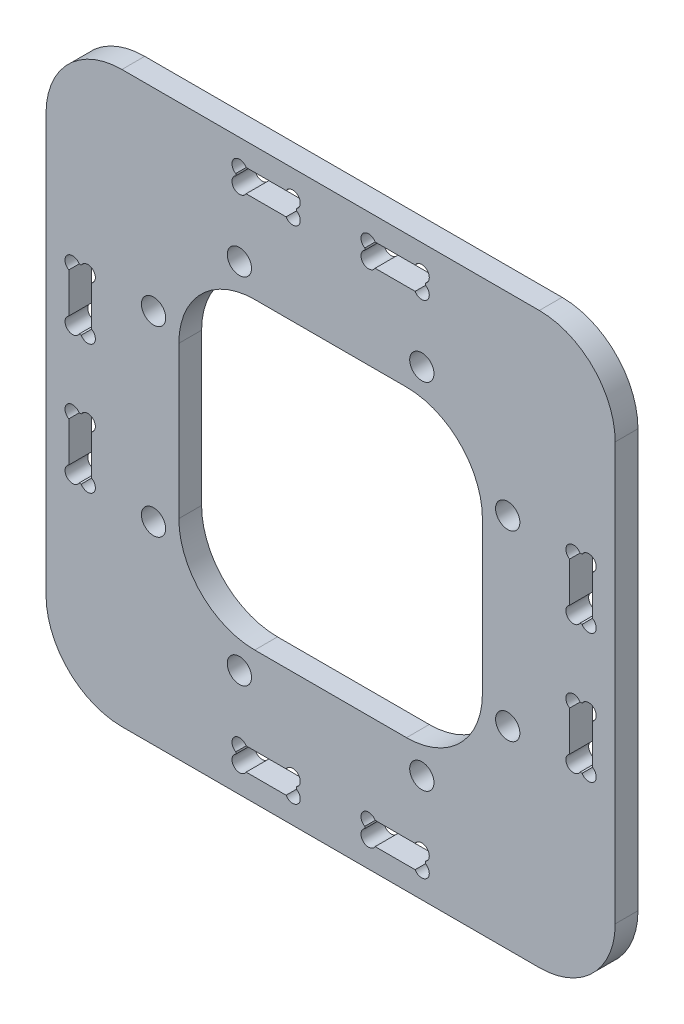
from build123d import *

# Parameters (mm, degrees)
SKETCH_1_W              = 75
SKETCH_1_H              = 75
SKETCH_1_W_2            = 40
SKETCH_1_H_2            = 40
EXTRUDE_1_DEPTH         = 3
HOLE_WIZARD_3_2_3_2_1_D = 3.2
SKETCH_4_W              = 8
SKETCH_4_H              = 3
SKETCH_4_W_2            = 3
SKETCH_4_H_2            = 8
CUT_EXTRUDE_1_DEPTH     = 3
HOLE_WIZARD_2_0_2_1_D   = 2
FILLET_1_R              = 10


with BuildPart() as part:
    # Sketch 1 → Extrude 1 (new body)
    with BuildSketch(Plane.XY):
        Rectangle(SKETCH_1_W, SKETCH_1_H)
        Rectangle(SKETCH_1_W_2, SKETCH_1_H_2, mode=Mode.SUBTRACT)
    extrude(amount=EXTRUDE_1_DEPTH)

    # Hole Wizard 3.2 _3.2_ _1 (through all)
    with Locations(Plane.XY.offset(3)):
        with Locations((-23.334523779, 12.02081528), (-23.334523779, -12.02081528), (-12.02081528, -23.334523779), (12.02081528, -23.334523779), (23.334523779, -12.02081528), (23.334523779, 12.02081528), (12.02081528, 23.334523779), (-12.02081528, 23.334523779)):
            Hole(HOLE_WIZARD_3_2_3_2_1_D / 2)

    # Sketch 4 → Cut-Extrude 1 (cut)
    with BuildSketch(Plane.XY.offset(3)):
        with Locations((-8.5, 33)):
            Rectangle(SKETCH_4_W, SKETCH_4_H)
        with Locations((8.5, 33)):
            Rectangle(SKETCH_4_W, SKETCH_4_H)
        with Locations((33, 8.5)):
            Rectangle(SKETCH_4_W_2, SKETCH_4_H_2)
        with Locations((33, -8.5)):
            Rectangle(SKETCH_4_W_2, SKETCH_4_H_2)
        with Locations((-33, -8.5)):
            Rectangle(SKETCH_4_W_2, SKETCH_4_H_2)
        with Locations((-33, 8.5)):
            Rectangle(SKETCH_4_W_2, SKETCH_4_H_2)
        with Locations((8.5, -33)):
            Rectangle(SKETCH_4_W, SKETCH_4_H)
        with Locations((-8.5, -33)):
            Rectangle(SKETCH_4_W, SKETCH_4_H)
    extrude(amount=-CUT_EXTRUDE_1_DEPTH, mode=Mode.SUBTRACT)

    # Hole Wizard 2.0 _2_ _1 (through all)
    with Locations(Plane.XY.offset(3)):
        with Locations((-34, 12), (-32, 12), (-32, 5), (-34, 5), (-34, -5), (-32, -5), (-32, -12), (-34, -12), (-12, -34), (-12, -32), (-5, -32), (-5, -34), (5, -34), (5, -32), (12, -32), (12, -34), (12, 34), (12, 32), (5, 32), (5, 34), (-5, 34), (-5, 32), (-12, 32), (-12, 34), (34, -12), (32, -12), (32, -5), (34, -5), (34, 5), (32, 5), (32, 12), (34, 12)):
            Hole(HOLE_WIZARD_2_0_2_1_D / 2)

    # Fillet 1
    fillet_1_edges = [part.edges().sort_by_distance(p)[0] for p in [
        (20, -20, 1.5),
        (20, 20, 1.5),
        (-20, 20, 1.5),
        (-20, -20, 1.5),
        (37.5, -37.5, 1.5),
        (-37.5, -37.5, 1.5),
        (-37.5, 37.5, 1.5),
        (37.5, 37.5, 1.5),
    ]]
    fillet(fillet_1_edges, radius=FILLET_1_R)


solid = part.part
